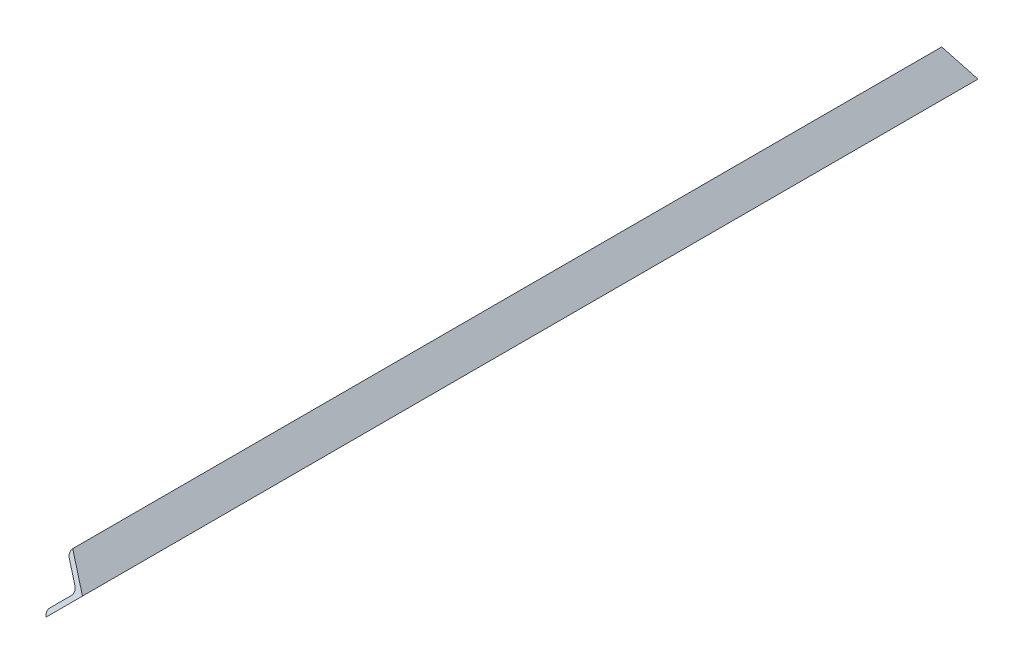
ISO-10303-21;
HEADER;
FILE_DESCRIPTION(('STEP AP214'),'2;1');
FILE_NAME('part.step','',(''),(''),'','','');
FILE_SCHEMA(('AUTOMOTIVE_DESIGN { 1 0 10303 214 1 1 1 1 }'));
ENDSEC;
DATA;
#1=APPLICATION_CONTEXT('core data for automotive mechanical design processes');
#2=APPLICATION_PROTOCOL_DEFINITION('international standard','automotive_design',2000,#1);
#3=PRODUCT_CONTEXT('',#1,'mechanical');
#4=PRODUCT('Part','Part','',(#3));
#5=PRODUCT_RELATED_PRODUCT_CATEGORY('part','',(#4));
#6=PRODUCT_DEFINITION_FORMATION('','',#4);
#7=PRODUCT_DEFINITION_CONTEXT('part definition',#1,'design');
#8=PRODUCT_DEFINITION('design','',#6,#7);
#9=PRODUCT_DEFINITION_SHAPE('','',#8);
#10=(LENGTH_UNIT() NAMED_UNIT(*) SI_UNIT(.MILLI.,.METRE.));
#11=(NAMED_UNIT(*) PLANE_ANGLE_UNIT() SI_UNIT($,.RADIAN.));
#12=(NAMED_UNIT(*) SI_UNIT($,.STERADIAN.) SOLID_ANGLE_UNIT());
#13=UNCERTAINTY_MEASURE_WITH_UNIT(LENGTH_MEASURE(1.E-05),#10,'distance_accuracy_value','');
#14=(GEOMETRIC_REPRESENTATION_CONTEXT(3) GLOBAL_UNCERTAINTY_ASSIGNED_CONTEXT((#13)) GLOBAL_UNIT_ASSIGNED_CONTEXT((#10,
#11,#12)) REPRESENTATION_CONTEXT('',''));
#15=CARTESIAN_POINT('',(0.,0.,0.));
#16=DIRECTION('',(0.,0.,1.));
#17=DIRECTION('',(1.,0.,0.));
#18=AXIS2_PLACEMENT_3D('',#15,#16,#17);
#19=CARTESIAN_POINT('',(-29.77501925,0.,-850.));
#20=DIRECTION('',(0.707106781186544,0.707106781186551,0.));
#21=DIRECTION('',(-0.707106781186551,0.707106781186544,0.));
#22=AXIS2_PLACEMENT_3D('',#19,#20,#21);
#23=PLANE('',#22);
#24=DIRECTION('',(-0.654653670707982,0.654653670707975,0.377964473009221));
#25=VECTOR('',#24,1.);
#26=CARTESIAN_POINT('',(-24.7187378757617,-5.05628137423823,-828.424347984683));
#27=LINE('',#26,#25);
#28=CARTESIAN_POINT('',(-29.77501925,0.,-825.505102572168));
#29=VERTEX_POINT('',#28);
#30=CARTESIAN_POINT('',(-72.2014261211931,42.4264068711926,-801.010205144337));
#31=VERTEX_POINT('',#30);
#32=EDGE_CURVE('E102',#29,#31,#27,.T.);
#33=ORIENTED_EDGE('',*,*,#32,.T.);
#34=DIRECTION('',(0.,0.,1.));
#35=VECTOR('',#34,1.);
#36=CARTESIAN_POINT('',(-72.2014261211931,42.4264068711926,-850.));
#37=LINE('',#36,#35);
#38=CARTESIAN_POINT('',(-72.2014261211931,42.4264068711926,801.010205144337));
#39=VERTEX_POINT('',#38);
#40=EDGE_CURVE('E42',#31,#39,#37,.T.);
#41=ORIENTED_EDGE('',*,*,#40,.T.);
#42=DIRECTION('',(0.654653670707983,-0.654653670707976,0.377964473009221));
#43=VECTOR('',#42,1.);
#44=CARTESIAN_POINT('',(-117.74842000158,87.9734007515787,774.713635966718));
#45=LINE('',#44,#43);
#46=CARTESIAN_POINT('',(-29.7750192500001,0.,825.505102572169));
#47=VERTEX_POINT('',#46);
#48=EDGE_CURVE('E131',#39,#47,#45,.T.);
#49=ORIENTED_EDGE('',*,*,#48,.T.);
#50=DIRECTION('',(0.,0.,1.));
#51=VECTOR('',#50,1.);
#52=CARTESIAN_POINT('',(-29.77501925,0.,-850.));
#53=LINE('',#52,#51);
#54=EDGE_CURVE('E11',#29,#47,#53,.T.);
#55=ORIENTED_EDGE('',*,*,#54,.F.);
#56=EDGE_LOOP('',(#33,#41,#49,#55));
#57=FACE_BOUND('',#56,.T.);
#58=ADVANCED_FACE('F39',(#57),#23,.T.);
#59=CARTESIAN_POINT('',(-29.77501925,0.,-850.));
#60=DIRECTION('',(0.707106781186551,-0.707106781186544,0.));
#61=DIRECTION('',(0.707106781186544,0.707106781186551,0.));
#62=AXIS2_PLACEMENT_3D('',#59,#60,#61);
#63=PLANE('',#62);
#64=DIRECTION('',(0.654653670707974,0.654653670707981,0.377964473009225));
#65=VECTOR('',#64,1.);
#66=CARTESIAN_POINT('',(-73.2060600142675,-43.431040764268,-850.580025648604));
#67=LINE('',#66,#65);
#68=CARTESIAN_POINT('',(-72.2014261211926,-42.4264068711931,-850.));
#69=VERTEX_POINT('',#68);
#70=EDGE_CURVE('E97',#69,#29,#67,.T.);
#71=ORIENTED_EDGE('',*,*,#70,.T.);
#72=ORIENTED_EDGE('',*,*,#54,.T.);
#73=DIRECTION('',(-0.654653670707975,-0.654653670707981,0.377964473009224));
#74=VECTOR('',#73,1.);
#75=CARTESIAN_POINT('',(19.8236221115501,49.5986413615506,796.869313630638));
#76=LINE('',#75,#74);
#77=CARTESIAN_POINT('',(-72.2014261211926,-42.4264068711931,850.));
#78=VERTEX_POINT('',#77);
#79=EDGE_CURVE('E118',#47,#78,#76,.T.);
#80=ORIENTED_EDGE('',*,*,#79,.T.);
#81=DIRECTION('',(0.,0.,1.));
#82=VECTOR('',#81,1.);
#83=CARTESIAN_POINT('',(-72.2014261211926,-42.4264068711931,-850.));
#84=LINE('',#83,#82);
#85=EDGE_CURVE('E47',#69,#78,#84,.T.);
#86=ORIENTED_EDGE('',*,*,#85,.F.);
#87=EDGE_LOOP('',(#71,#72,#80,#86));
#88=FACE_BOUND('',#87,.T.);
#89=ADVANCED_FACE('F116',(#88),#63,.T.);
#90=CARTESIAN_POINT('',(-66.5445718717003,-36.7695526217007,-850.));
#91=DIRECTION('',(0.,0.,1.));
#92=DIRECTION('',(1.,0.,0.));
#93=AXIS2_PLACEMENT_3D('',#90,#91,#92);
#94=CYLINDRICAL_SURFACE('',#93,8.00000000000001);
#95=CARTESIAN_POINT('',(-66.5445718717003,-36.7695526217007,-846.734013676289));
#96=DIRECTION('',(0.,-0.499999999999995,0.866025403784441));
#97=DIRECTION('',(0.,0.866025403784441,0.499999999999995));
#98=AXIS2_PLACEMENT_3D('',#95,#96,#97);
#99=ELLIPSE('',#98,9.23760430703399,8.00000000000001);
#100=CARTESIAN_POINT('',(-72.2014261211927,-31.1126983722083,-843.468027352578));
#101=VERTEX_POINT('',#100);
#102=EDGE_CURVE('E100',#101,#69,#99,.T.);
#103=ORIENTED_EDGE('',*,*,#102,.T.);
#104=ORIENTED_EDGE('',*,*,#85,.T.);
#105=CARTESIAN_POINT('',(-66.5445718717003,-36.7695526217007,846.734013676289));
#106=DIRECTION('',(0.,-0.499999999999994,-0.866025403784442));
#107=DIRECTION('',(0.,-0.866025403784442,0.499999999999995));
#108=AXIS2_PLACEMENT_3D('',#105,#106,#107);
#109=ELLIPSE('',#108,9.23760430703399,8.00000000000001);
#110=CARTESIAN_POINT('',(-72.2014261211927,-31.1126983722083,843.468027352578));
#111=VERTEX_POINT('',#110);
#112=EDGE_CURVE('E132',#78,#111,#109,.T.);
#113=ORIENTED_EDGE('',*,*,#112,.T.);
#114=DIRECTION('',(0.,0.,1.));
#115=VECTOR('',#114,1.);
#116=CARTESIAN_POINT('',(-72.2014261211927,-31.1126983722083,-850.));
#117=LINE('',#116,#115);
#118=EDGE_CURVE('E112',#101,#111,#117,.T.);
#119=ORIENTED_EDGE('',*,*,#118,.F.);
#120=EDGE_LOOP('',(#103,#104,#113,#119));
#121=FACE_BOUND('',#120,.T.);
#122=ADVANCED_FACE('F110',(#121),#94,.T.);
#123=CARTESIAN_POINT('',(-72.2014261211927,-31.1126983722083,-850.));
#124=DIRECTION('',(-0.707106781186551,0.707106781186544,0.));
#125=DIRECTION('',(-0.707106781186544,-0.707106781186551,0.));
#126=AXIS2_PLACEMENT_3D('',#123,#124,#125);
#127=PLANE('',#126);
#128=DIRECTION('',(-0.654653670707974,-0.654653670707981,-0.377964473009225));
#129=VECTOR('',#128,1.);
#130=CARTESIAN_POINT('',(-79.6710362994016,-38.5823085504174,-847.780608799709));
#131=LINE('',#130,#129);
#132=CARTESIAN_POINT('',(-46.7455819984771,-5.65685424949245,-828.771088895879));
#133=VERTEX_POINT('',#132);
#134=EDGE_CURVE('E113',#133,#101,#131,.T.);
#135=ORIENTED_EDGE('',*,*,#134,.T.);
#136=ORIENTED_EDGE('',*,*,#118,.T.);
#137=DIRECTION('',(0.654653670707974,0.654653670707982,-0.377964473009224));
#138=VECTOR('',#137,1.);
#139=CARTESIAN_POINT('',(13.358645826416,54.4473735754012,794.069896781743));
#140=LINE('',#139,#138);
#141=CARTESIAN_POINT('',(-46.7455819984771,-5.65685424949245,828.771088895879));
#142=VERTEX_POINT('',#141);
#143=EDGE_CURVE('E136',#111,#142,#140,.T.);
#144=ORIENTED_EDGE('',*,*,#143,.T.);
#145=DIRECTION('',(0.,0.,1.));
#146=VECTOR('',#145,1.);
#147=CARTESIAN_POINT('',(-46.7455819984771,-5.65685424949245,-850.));
#148=LINE('',#147,#146);
#149=EDGE_CURVE('E120',#133,#142,#148,.T.);
#150=ORIENTED_EDGE('',*,*,#149,.F.);
#151=EDGE_LOOP('',(#135,#136,#144,#150));
#152=FACE_BOUND('',#151,.T.);
#153=ADVANCED_FACE('F167',(#152),#127,.T.);
#154=CARTESIAN_POINT('',(-52.4024362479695,-1.00613961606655E-13,-850.));
#155=DIRECTION('',(0.,0.,1.));
#156=DIRECTION('',(1.,0.,0.));
#157=AXIS2_PLACEMENT_3D('',#154,#155,#156);
#158=CYLINDRICAL_SURFACE('',#157,8.);
#159=CARTESIAN_POINT('',(-52.4024362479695,-1.00613961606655E-13,-825.505102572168));
#160=DIRECTION('',(0.,-0.499999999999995,0.866025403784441));
#161=DIRECTION('',(0.,0.866025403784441,0.499999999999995));
#162=AXIS2_PLACEMENT_3D('',#159,#160,#161);
#163=ELLIPSE('',#162,9.23760430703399,8.);
#164=CARTESIAN_POINT('',(-46.7455819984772,5.6568542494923,-822.239116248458));
#165=VERTEX_POINT('',#164);
#166=EDGE_CURVE('E149',#165,#133,#163,.F.);
#167=ORIENTED_EDGE('',*,*,#166,.T.);
#168=ORIENTED_EDGE('',*,*,#149,.T.);
#169=CARTESIAN_POINT('',(-52.4024362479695,-1.00613961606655E-13,825.505102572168));
#170=DIRECTION('',(0.,-0.499999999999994,-0.866025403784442));
#171=DIRECTION('',(0.,-0.866025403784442,0.499999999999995));
#172=AXIS2_PLACEMENT_3D('',#169,#170,#171);
#173=ELLIPSE('',#172,9.23760430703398,8.);
#174=CARTESIAN_POINT('',(-46.7455819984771,5.65685424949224,822.239116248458));
#175=VERTEX_POINT('',#174);
#176=EDGE_CURVE('E139',#142,#175,#173,.F.);
#177=ORIENTED_EDGE('',*,*,#176,.T.);
#178=DIRECTION('',(0.,0.,1.));
#179=VECTOR('',#178,1.);
#180=CARTESIAN_POINT('',(-46.7455819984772,5.65685424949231,-850.));
#181=LINE('',#180,#179);
#182=EDGE_CURVE('E125',#165,#175,#181,.T.);
#183=ORIENTED_EDGE('',*,*,#182,.F.);
#184=EDGE_LOOP('',(#167,#168,#177,#183));
#185=FACE_BOUND('',#184,.T.);
#186=ADVANCED_FACE('F164',(#185),#158,.F.);
#187=CARTESIAN_POINT('',(-72.201426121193,31.1126983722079,-850.));
#188=DIRECTION('',(-0.707106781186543,-0.707106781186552,0.));
#189=DIRECTION('',(0.707106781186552,-0.707106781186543,0.));
#190=AXIS2_PLACEMENT_3D('',#187,#188,#189);
#191=PLANE('',#190);
#192=DIRECTION('',(0.654653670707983,-0.654653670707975,-0.377964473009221));
#193=VECTOR('',#192,1.);
#194=CARTESIAN_POINT('',(-31.1837141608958,-9.90501358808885,-831.223764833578));
#195=LINE('',#194,#193);
#196=CARTESIAN_POINT('',(-72.201426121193,31.1126983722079,-807.542177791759));
#197=VERTEX_POINT('',#196);
#198=EDGE_CURVE('E55',#197,#165,#195,.T.);
#199=ORIENTED_EDGE('',*,*,#198,.T.);
#200=ORIENTED_EDGE('',*,*,#182,.T.);
#201=DIRECTION('',(-0.654653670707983,0.654653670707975,-0.37796447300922));
#202=VECTOR('',#201,1.);
#203=CARTESIAN_POINT('',(-124.213396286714,83.124668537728,777.513052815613));
#204=LINE('',#203,#202);
#205=CARTESIAN_POINT('',(-72.201426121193,31.1126983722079,807.542177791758));
#206=VERTEX_POINT('',#205);
#207=EDGE_CURVE('E142',#175,#206,#204,.T.);
#208=ORIENTED_EDGE('',*,*,#207,.T.);
#209=DIRECTION('',(0.,0.,1.));
#210=VECTOR('',#209,1.);
#211=CARTESIAN_POINT('',(-72.201426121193,31.1126983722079,-850.));
#212=LINE('',#211,#210);
#213=EDGE_CURVE('E126',#197,#206,#212,.T.);
#214=ORIENTED_EDGE('',*,*,#213,.F.);
#215=EDGE_LOOP('',(#199,#200,#208,#214));
#216=FACE_BOUND('',#215,.T.);
#217=ADVANCED_FACE('F156',(#216),#191,.T.);
#218=CARTESIAN_POINT('',(-66.5445718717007,36.7695526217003,-850.));
#219=DIRECTION('',(0.,0.,1.));
#220=DIRECTION('',(1.,0.,0.));
#221=AXIS2_PLACEMENT_3D('',#218,#219,#220);
#222=CYLINDRICAL_SURFACE('',#221,8.00000000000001);
#223=CARTESIAN_POINT('',(-66.5445718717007,36.7695526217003,-804.276191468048));
#224=DIRECTION('',(0.,-0.499999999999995,0.866025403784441));
#225=DIRECTION('',(0.,0.866025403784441,0.499999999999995));
#226=AXIS2_PLACEMENT_3D('',#223,#224,#225);
#227=ELLIPSE('',#226,9.23760430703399,8.00000000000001);
#228=EDGE_CURVE('E153',#31,#197,#227,.T.);
#229=ORIENTED_EDGE('',*,*,#228,.T.);
#230=ORIENTED_EDGE('',*,*,#213,.T.);
#231=CARTESIAN_POINT('',(-66.5445718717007,36.7695526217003,804.276191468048));
#232=DIRECTION('',(0.,-0.499999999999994,-0.866025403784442));
#233=DIRECTION('',(0.,-0.866025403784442,0.499999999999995));
#234=AXIS2_PLACEMENT_3D('',#231,#232,#233);
#235=ELLIPSE('',#234,9.23760430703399,8.00000000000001);
#236=EDGE_CURVE('E145',#206,#39,#235,.T.);
#237=ORIENTED_EDGE('',*,*,#236,.T.);
#238=ORIENTED_EDGE('',*,*,#40,.F.);
#239=EDGE_LOOP('',(#229,#230,#237,#238));
#240=FACE_BOUND('',#239,.T.);
#241=ADVANCED_FACE('F154',(#240),#222,.T.);
#242=CARTESIAN_POINT('',(-74.5455718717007,120.375536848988,756.00625396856));
#243=DIRECTION('',(0.,-0.499999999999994,-0.866025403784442));
#244=DIRECTION('',(0.,0.866025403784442,-0.499999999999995));
#245=AXIS2_PLACEMENT_3D('',#242,#243,#244);
#246=PLANE('',#245);
#247=ORIENTED_EDGE('',*,*,#236,.F.);
#248=ORIENTED_EDGE('',*,*,#207,.F.);
#249=ORIENTED_EDGE('',*,*,#176,.F.);
#250=ORIENTED_EDGE('',*,*,#143,.F.);
#251=ORIENTED_EDGE('',*,*,#112,.F.);
#252=ORIENTED_EDGE('',*,*,#79,.F.);
#253=ORIENTED_EDGE('',*,*,#48,.F.);
#254=EDGE_LOOP('',(#247,#248,#249,#250,#251,#252,#253));
#255=FACE_BOUND('',#254,.T.);
#256=ADVANCED_FACE('F161',(#255),#246,.F.);
#257=CARTESIAN_POINT('',(-74.5455718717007,-42.4264068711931,-850.));
#258=DIRECTION('',(0.,-0.499999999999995,0.866025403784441));
#259=DIRECTION('',(0.,-0.866025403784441,-0.499999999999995));
#260=AXIS2_PLACEMENT_3D('',#257,#258,#259);
#261=PLANE('',#260);
#262=ORIENTED_EDGE('',*,*,#70,.F.);
#263=ORIENTED_EDGE('',*,*,#102,.F.);
#264=ORIENTED_EDGE('',*,*,#134,.F.);
#265=ORIENTED_EDGE('',*,*,#166,.F.);
#266=ORIENTED_EDGE('',*,*,#198,.F.);
#267=ORIENTED_EDGE('',*,*,#228,.F.);
#268=ORIENTED_EDGE('',*,*,#32,.F.);
#269=EDGE_LOOP('',(#262,#263,#264,#265,#266,#267,#268));
#270=FACE_BOUND('',#269,.T.);
#271=ADVANCED_FACE('F99',(#270),#261,.F.);
#272=CLOSED_SHELL('',(#58,#89,#122,#153,#186,#217,#241,#256,#271));
#273=MANIFOLD_SOLID_BREP('B2',#272);
#274=ADVANCED_BREP_SHAPE_REPRESENTATION('',(#18,#273),#14);
#275=SHAPE_DEFINITION_REPRESENTATION(#9,#274);
ENDSEC;
END-ISO-10303-21;
